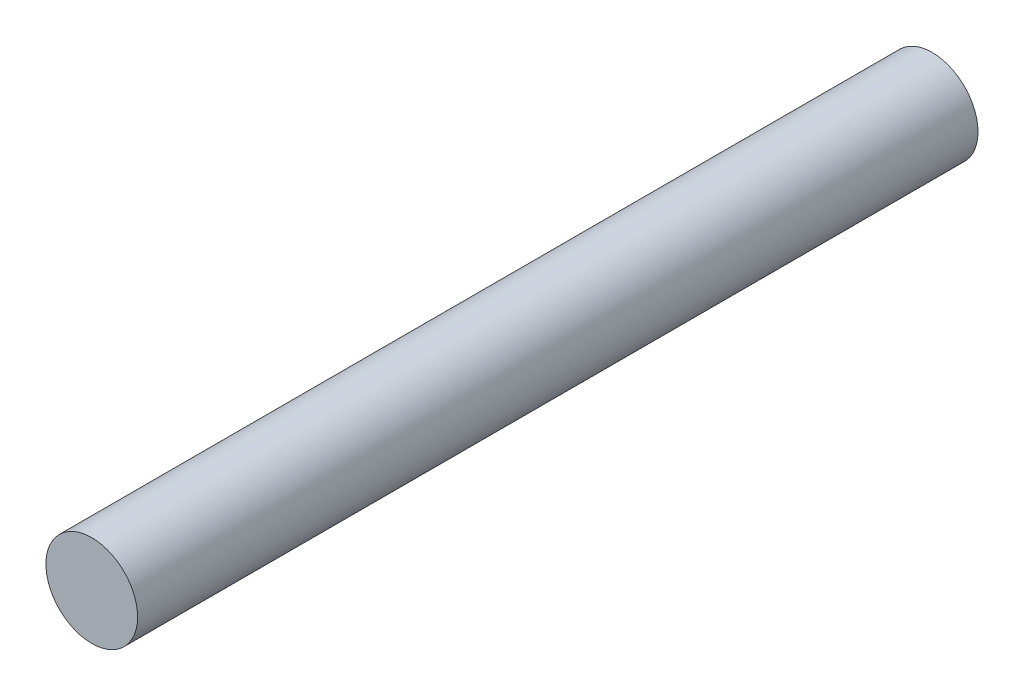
ISO-10303-21;
HEADER;
FILE_DESCRIPTION(('STEP AP214'),'2;1');
FILE_NAME('part.step','',(''),(''),'','','');
FILE_SCHEMA(('AUTOMOTIVE_DESIGN { 1 0 10303 214 1 1 1 1 }'));
ENDSEC;
DATA;
#1=APPLICATION_CONTEXT('core data for automotive mechanical design processes');
#2=APPLICATION_PROTOCOL_DEFINITION('international standard','automotive_design',2000,#1);
#3=PRODUCT_CONTEXT('',#1,'mechanical');
#4=PRODUCT('Part','Part','',(#3));
#5=PRODUCT_RELATED_PRODUCT_CATEGORY('part','',(#4));
#6=PRODUCT_DEFINITION_FORMATION('','',#4);
#7=PRODUCT_DEFINITION_CONTEXT('part definition',#1,'design');
#8=PRODUCT_DEFINITION('design','',#6,#7);
#9=PRODUCT_DEFINITION_SHAPE('','',#8);
#10=(LENGTH_UNIT() NAMED_UNIT(*) SI_UNIT(.MILLI.,.METRE.));
#11=(NAMED_UNIT(*) PLANE_ANGLE_UNIT() SI_UNIT($,.RADIAN.));
#12=(NAMED_UNIT(*) SI_UNIT($,.STERADIAN.) SOLID_ANGLE_UNIT());
#13=UNCERTAINTY_MEASURE_WITH_UNIT(LENGTH_MEASURE(1.E-05),#10,'distance_accuracy_value','');
#14=(GEOMETRIC_REPRESENTATION_CONTEXT(3) GLOBAL_UNCERTAINTY_ASSIGNED_CONTEXT((#13)) GLOBAL_UNIT_ASSIGNED_CONTEXT((#10,
#11,#12)) REPRESENTATION_CONTEXT('',''));
#15=CARTESIAN_POINT('',(0.,0.,0.));
#16=DIRECTION('',(0.,0.,1.));
#17=DIRECTION('',(1.,0.,0.));
#18=AXIS2_PLACEMENT_3D('',#15,#16,#17);
#19=CARTESIAN_POINT('',(0.,0.,-550.));
#20=DIRECTION('',(0.,0.,1.));
#21=DIRECTION('',(1.,0.,0.));
#22=AXIS2_PLACEMENT_3D('',#19,#20,#21);
#23=CYLINDRICAL_SURFACE('',#22,30.);
#24=CARTESIAN_POINT('',(0.,0.,-550.));
#25=DIRECTION('',(0.,0.,1.));
#26=DIRECTION('',(1.,0.,0.));
#27=AXIS2_PLACEMENT_3D('',#24,#25,#26);
#28=CIRCLE('',#27,30.);
#29=CARTESIAN_POINT('',(30.,0.,-550.));
#30=VERTEX_POINT('',#29);
#31=EDGE_CURVE('E10',#30,#30,#28,.T.);
#32=ORIENTED_EDGE('',*,*,#31,.T.);
#33=EDGE_LOOP('',(#32));
#34=FACE_BOUND('',#33,.T.);
#35=CARTESIAN_POINT('',(0.,0.,0.));
#36=DIRECTION('',(0.,0.,1.));
#37=DIRECTION('',(1.,0.,0.));
#38=AXIS2_PLACEMENT_3D('',#35,#36,#37);
#39=CIRCLE('',#38,30.);
#40=CARTESIAN_POINT('',(30.,0.,0.));
#41=VERTEX_POINT('',#40);
#42=EDGE_CURVE('E40',#41,#41,#39,.T.);
#43=ORIENTED_EDGE('',*,*,#42,.F.);
#44=EDGE_LOOP('',(#43));
#45=FACE_BOUND('',#44,.T.);
#46=ADVANCED_FACE('F37',(#34,#45),#23,.T.);
#47=CARTESIAN_POINT('',(0.,0.,-550.));
#48=DIRECTION('',(0.,0.,1.));
#49=DIRECTION('',(1.,0.,0.));
#50=AXIS2_PLACEMENT_3D('',#47,#48,#49);
#51=PLANE('',#50);
#52=ORIENTED_EDGE('',*,*,#31,.F.);
#53=EDGE_LOOP('',(#52));
#54=FACE_BOUND('',#53,.T.);
#55=ADVANCED_FACE('F54',(#54),#51,.F.);
#56=CARTESIAN_POINT('',(0.,0.,0.));
#57=DIRECTION('',(0.,0.,1.));
#58=DIRECTION('',(1.,0.,0.));
#59=AXIS2_PLACEMENT_3D('',#56,#57,#58);
#60=PLANE('',#59);
#61=ORIENTED_EDGE('',*,*,#42,.T.);
#62=EDGE_LOOP('',(#61));
#63=FACE_BOUND('',#62,.T.);
#64=ADVANCED_FACE('F51',(#63),#60,.T.);
#65=CLOSED_SHELL('',(#46,#55,#64));
#66=MANIFOLD_SOLID_BREP('B2',#65);
#67=ADVANCED_BREP_SHAPE_REPRESENTATION('',(#18,#66),#14);
#68=SHAPE_DEFINITION_REPRESENTATION(#9,#67);
ENDSEC;
END-ISO-10303-21;
